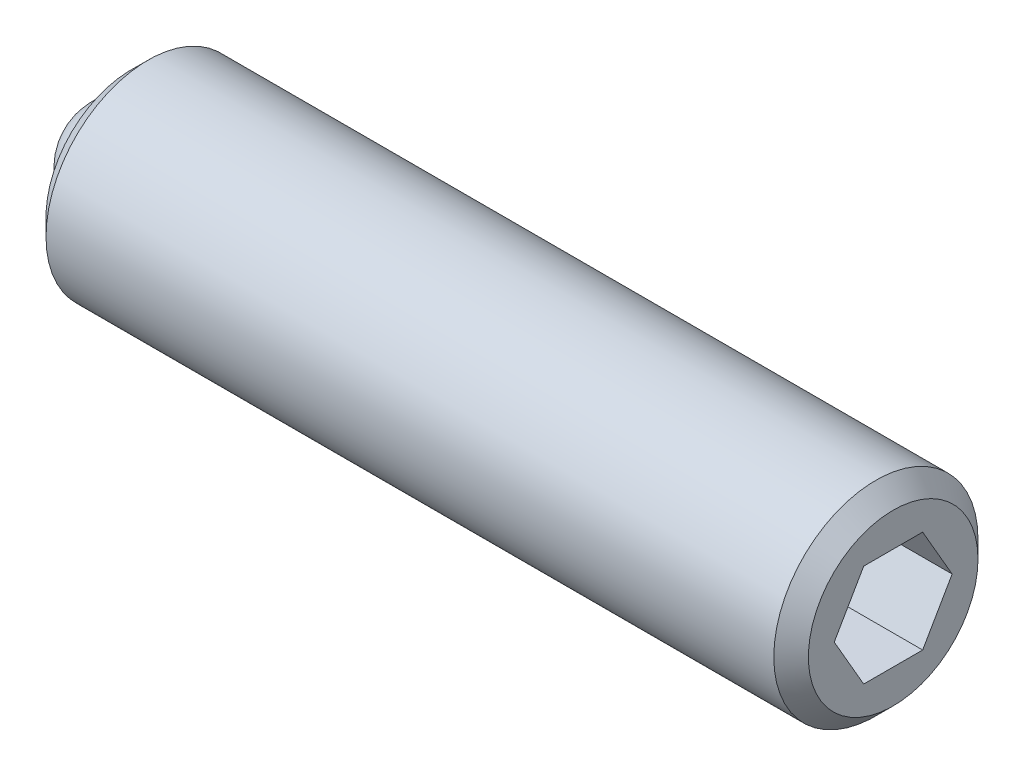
ISO-10303-21;
HEADER;
FILE_DESCRIPTION(('STEP AP214'),'2;1');
FILE_NAME('part.step','',(''),(''),'','','');
FILE_SCHEMA(('AUTOMOTIVE_DESIGN { 1 0 10303 214 1 1 1 1 }'));
ENDSEC;
DATA;
#1=APPLICATION_CONTEXT('core data for automotive mechanical design processes');
#2=APPLICATION_PROTOCOL_DEFINITION('international standard','automotive_design',2000,#1);
#3=PRODUCT_CONTEXT('',#1,'mechanical');
#4=PRODUCT('Part','Part','',(#3));
#5=PRODUCT_RELATED_PRODUCT_CATEGORY('part','',(#4));
#6=PRODUCT_DEFINITION_FORMATION('','',#4);
#7=PRODUCT_DEFINITION_CONTEXT('part definition',#1,'design');
#8=PRODUCT_DEFINITION('design','',#6,#7);
#9=PRODUCT_DEFINITION_SHAPE('','',#8);
#10=(LENGTH_UNIT() NAMED_UNIT(*) SI_UNIT(.MILLI.,.METRE.));
#11=(NAMED_UNIT(*) PLANE_ANGLE_UNIT() SI_UNIT($,.RADIAN.));
#12=(NAMED_UNIT(*) SI_UNIT($,.STERADIAN.) SOLID_ANGLE_UNIT());
#13=UNCERTAINTY_MEASURE_WITH_UNIT(LENGTH_MEASURE(1.E-05),#10,'distance_accuracy_value','');
#14=(GEOMETRIC_REPRESENTATION_CONTEXT(3) GLOBAL_UNCERTAINTY_ASSIGNED_CONTEXT((#13)) GLOBAL_UNIT_ASSIGNED_CONTEXT((#10,
#11,#12)) REPRESENTATION_CONTEXT('',''));
#15=CARTESIAN_POINT('',(0.,0.,0.));
#16=DIRECTION('',(0.,0.,1.));
#17=DIRECTION('',(1.,0.,0.));
#18=AXIS2_PLACEMENT_3D('',#15,#16,#17);
#19=CARTESIAN_POINT('',(0.,0.,0.));
#20=DIRECTION('',(0.,-1.,0.));
#21=DIRECTION('',(0.,0.,-1.));
#22=AXIS2_PLACEMENT_3D('',#19,#20,#21);
#23=SPHERICAL_SURFACE('',#22,0.8);
#24=CARTESIAN_POINT('',(0.,-0.8,0.));
#25=VERTEX_POINT('',#24);
#26=VERTEX_LOOP('',#25);
#27=FACE_BOUND('',#26,.T.);
#28=ADVANCED_FACE('F41',(#27),#23,.T.);
#29=CLOSED_SHELL('',(#28));
#30=MANIFOLD_SOLID_BREP('B2',#29);
#31=CARTESIAN_POINT('',(11.2,0.,0.));
#32=DIRECTION('',(-1.,0.,0.));
#33=DIRECTION('',(0.,0.,1.));
#34=AXIS2_PLACEMENT_3D('',#31,#32,#33);
#35=CYLINDRICAL_SURFACE('',#34,1.5);
#36=CARTESIAN_POINT('',(10.946,0.,0.));
#37=DIRECTION('',(1.,0.,0.));
#38=DIRECTION('',(0.,0.,-1.));
#39=AXIS2_PLACEMENT_3D('',#36,#37,#38);
#40=CIRCLE('',#39,1.5);
#41=CARTESIAN_POINT('',(10.946,0.,-1.5));
#42=VERTEX_POINT('',#41);
#43=EDGE_CURVE('E39',#42,#42,#40,.F.);
#44=ORIENTED_EDGE('',*,*,#43,.T.);
#45=EDGE_LOOP('',(#44));
#46=FACE_BOUND('',#45,.T.);
#47=CARTESIAN_POINT('',(0.254000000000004,0.,0.));
#48=DIRECTION('',(1.,0.,0.));
#49=DIRECTION('',(0.,0.,-1.));
#50=AXIS2_PLACEMENT_3D('',#47,#48,#49);
#51=CIRCLE('',#50,1.5);
#52=CARTESIAN_POINT('',(0.254000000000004,0.,-1.5));
#53=VERTEX_POINT('',#52);
#54=EDGE_CURVE('E176',#53,#53,#51,.T.);
#55=ORIENTED_EDGE('',*,*,#54,.T.);
#56=EDGE_LOOP('',(#55));
#57=FACE_BOUND('',#56,.T.);
#58=ADVANCED_FACE('F54',(#46,#57),#35,.T.);
#59=CARTESIAN_POINT('',(11.2,0.,0.));
#60=DIRECTION('',(1.,0.,0.));
#61=DIRECTION('',(0.,0.,-1.));
#62=AXIS2_PLACEMENT_3D('',#59,#60,#61);
#63=PLANE('',#62);
#64=DIRECTION('',(0.,0.866025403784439,-0.5));
#65=VECTOR('',#64,1.);
#66=CARTESIAN_POINT('',(11.2,-0.75,-0.43301270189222));
#67=LINE('',#66,#65);
#68=CARTESIAN_POINT('',(11.2,-0.75,-0.43301270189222));
#69=VERTEX_POINT('',#68);
#70=CARTESIAN_POINT('',(11.2,0.,-0.866025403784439));
#71=VERTEX_POINT('',#70);
#72=EDGE_CURVE('E77',#69,#71,#67,.T.);
#73=ORIENTED_EDGE('',*,*,#72,.F.);
#74=DIRECTION('',(0.,0.,-1.));
#75=VECTOR('',#74,1.);
#76=CARTESIAN_POINT('',(11.2,-0.75,0.433012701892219));
#77=LINE('',#76,#75);
#78=CARTESIAN_POINT('',(11.2,-0.75,0.433012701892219));
#79=VERTEX_POINT('',#78);
#80=EDGE_CURVE('E143',#79,#69,#77,.T.);
#81=ORIENTED_EDGE('',*,*,#80,.F.);
#82=DIRECTION('',(0.,-0.866025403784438,-0.5));
#83=VECTOR('',#82,1.);
#84=CARTESIAN_POINT('',(11.2,0.,0.866025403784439));
#85=LINE('',#84,#83);
#86=CARTESIAN_POINT('',(11.2,0.,0.866025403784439));
#87=VERTEX_POINT('',#86);
#88=EDGE_CURVE('E169',#87,#79,#85,.T.);
#89=ORIENTED_EDGE('',*,*,#88,.F.);
#90=DIRECTION('',(0.,-0.866025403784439,0.5));
#91=VECTOR('',#90,1.);
#92=CARTESIAN_POINT('',(11.2,0.75,0.433012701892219));
#93=LINE('',#92,#91);
#94=CARTESIAN_POINT('',(11.2,0.75,0.433012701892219));
#95=VERTEX_POINT('',#94);
#96=EDGE_CURVE('E166',#95,#87,#93,.T.);
#97=ORIENTED_EDGE('',*,*,#96,.F.);
#98=DIRECTION('',(0.,0.,1.));
#99=VECTOR('',#98,1.);
#100=CARTESIAN_POINT('',(11.2,0.75,-0.433012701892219));
#101=LINE('',#100,#99);
#102=CARTESIAN_POINT('',(11.2,0.75,-0.433012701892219));
#103=VERTEX_POINT('',#102);
#104=EDGE_CURVE('E163',#103,#95,#101,.T.);
#105=ORIENTED_EDGE('',*,*,#104,.F.);
#106=DIRECTION('',(0.,0.866025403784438,0.5));
#107=VECTOR('',#106,1.);
#108=CARTESIAN_POINT('',(11.2,0.,-0.866025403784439));
#109=LINE('',#108,#107);
#110=EDGE_CURVE('E160',#71,#103,#109,.T.);
#111=ORIENTED_EDGE('',*,*,#110,.F.);
#112=EDGE_LOOP('',(#73,#81,#89,#97,#105,#111));
#113=FACE_BOUND('',#112,.T.);
#114=CARTESIAN_POINT('',(11.2,0.,0.));
#115=DIRECTION('',(1.,0.,0.));
#116=DIRECTION('',(0.,0.,-1.));
#117=AXIS2_PLACEMENT_3D('',#114,#115,#116);
#118=CIRCLE('',#117,1.246);
#119=CARTESIAN_POINT('',(11.2,0.,-1.246));
#120=VERTEX_POINT('',#119);
#121=EDGE_CURVE('E62',#120,#120,#118,.T.);
#122=ORIENTED_EDGE('',*,*,#121,.T.);
#123=EDGE_LOOP('',(#122));
#124=FACE_BOUND('',#123,.T.);
#125=ADVANCED_FACE('F193',(#113,#124),#63,.T.);
#126=CARTESIAN_POINT('',(0.,0.,0.));
#127=DIRECTION('',(1.,0.,0.));
#128=DIRECTION('',(0.,0.,-1.));
#129=AXIS2_PLACEMENT_3D('',#126,#127,#128);
#130=PLANE('',#129);
#131=CARTESIAN_POINT('',(0.,0.,0.));
#132=DIRECTION('',(-1.,0.,0.));
#133=DIRECTION('',(0.,0.,1.));
#134=AXIS2_PLACEMENT_3D('',#131,#132,#133);
#135=CIRCLE('',#134,0.8);
#136=CARTESIAN_POINT('',(0.,0.79747984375,-0.0634499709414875));
#137=VERTEX_POINT('',#136);
#138=CARTESIAN_POINT('',(0.,0.79747984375,0.0634499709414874));
#139=VERTEX_POINT('',#138);
#140=EDGE_CURVE('E128',#137,#139,#135,.T.);
#141=ORIENTED_EDGE('',*,*,#140,.F.);
#142=CARTESIAN_POINT('',(0.,0.8,0.));
#143=DIRECTION('',(-1.,0.,0.));
#144=DIRECTION('',(0.,0.,1.));
#145=AXIS2_PLACEMENT_3D('',#142,#143,#144);
#146=CIRCLE('',#145,0.0635000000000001);
#147=EDGE_CURVE('E117',#139,#137,#146,.T.);
#148=ORIENTED_EDGE('',*,*,#147,.F.);
#149=EDGE_LOOP('',(#141,#148));
#150=FACE_BOUND('',#149,.T.);
#151=CARTESIAN_POINT('',(0.,0.,0.));
#152=DIRECTION('',(1.,0.,0.));
#153=DIRECTION('',(0.,0.,-1.));
#154=AXIS2_PLACEMENT_3D('',#151,#152,#153);
#155=CIRCLE('',#154,1.246);
#156=CARTESIAN_POINT('',(0.,0.,-1.246));
#157=VERTEX_POINT('',#156);
#158=EDGE_CURVE('E188',#157,#157,#155,.F.);
#159=ORIENTED_EDGE('',*,*,#158,.T.);
#160=EDGE_LOOP('',(#159));
#161=FACE_BOUND('',#160,.T.);
#162=ADVANCED_FACE('F132',(#150,#161),#130,.F.);
#163=CARTESIAN_POINT('',(0.254000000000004,0.,0.));
#164=DIRECTION('',(1.,0.,0.));
#165=DIRECTION('',(0.,0.,-1.));
#166=AXIS2_PLACEMENT_3D('',#163,#164,#165);
#167=CONICAL_SURFACE('',#166,1.5,0.785398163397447);
#168=ORIENTED_EDGE('',*,*,#158,.F.);
#169=EDGE_LOOP('',(#168));
#170=FACE_BOUND('',#169,.T.);
#171=ORIENTED_EDGE('',*,*,#54,.F.);
#172=EDGE_LOOP('',(#171));
#173=FACE_BOUND('',#172,.T.);
#174=ADVANCED_FACE('F197',(#170,#173),#167,.T.);
#175=CARTESIAN_POINT('',(11.2,0.,0.));
#176=DIRECTION('',(-1.,0.,0.));
#177=DIRECTION('',(0.,0.,1.));
#178=AXIS2_PLACEMENT_3D('',#175,#176,#177);
#179=CONICAL_SURFACE('',#178,1.246,0.785398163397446);
#180=ORIENTED_EDGE('',*,*,#43,.F.);
#181=EDGE_LOOP('',(#180));
#182=FACE_BOUND('',#181,.T.);
#183=ORIENTED_EDGE('',*,*,#121,.F.);
#184=EDGE_LOOP('',(#183));
#185=FACE_BOUND('',#184,.T.);
#186=ADVANCED_FACE('F56',(#182,#185),#179,.T.);
#187=CARTESIAN_POINT('',(9.2,-0.75,-0.43301270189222));
#188=DIRECTION('',(0.,-0.5,-0.866025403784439));
#189=DIRECTION('',(0.,0.866025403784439,-0.5));
#190=AXIS2_PLACEMENT_3D('',#187,#188,#189);
#191=PLANE('',#190);
#192=ORIENTED_EDGE('',*,*,#72,.T.);
#193=DIRECTION('',(1.,0.,0.));
#194=VECTOR('',#193,1.);
#195=CARTESIAN_POINT('',(9.2,0.,-0.866025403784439));
#196=LINE('',#195,#194);
#197=CARTESIAN_POINT('',(9.2,0.,-0.866025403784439));
#198=VERTEX_POINT('',#197);
#199=EDGE_CURVE('E158',#198,#71,#196,.T.);
#200=ORIENTED_EDGE('',*,*,#199,.F.);
#201=DIRECTION('',(0.,0.866025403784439,-0.5));
#202=VECTOR('',#201,1.);
#203=CARTESIAN_POINT('',(9.2,-0.75,-0.43301270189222));
#204=LINE('',#203,#202);
#205=CARTESIAN_POINT('',(9.2,-0.75,-0.43301270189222));
#206=VERTEX_POINT('',#205);
#207=EDGE_CURVE('E139',#206,#198,#204,.T.);
#208=ORIENTED_EDGE('',*,*,#207,.F.);
#209=DIRECTION('',(1.,0.,0.));
#210=VECTOR('',#209,1.);
#211=CARTESIAN_POINT('',(9.2,-0.75,-0.43301270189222));
#212=LINE('',#211,#210);
#213=EDGE_CURVE('E174',#206,#69,#212,.T.);
#214=ORIENTED_EDGE('',*,*,#213,.T.);
#215=EDGE_LOOP('',(#192,#200,#208,#214));
#216=FACE_BOUND('',#215,.T.);
#217=ADVANCED_FACE('F196',(#216),#191,.F.);
#218=CARTESIAN_POINT('',(9.2,-0.75,0.433012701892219));
#219=DIRECTION('',(0.,-1.,0.));
#220=DIRECTION('',(0.,0.,-1.));
#221=AXIS2_PLACEMENT_3D('',#218,#219,#220);
#222=PLANE('',#221);
#223=ORIENTED_EDGE('',*,*,#80,.T.);
#224=ORIENTED_EDGE('',*,*,#213,.F.);
#225=DIRECTION('',(0.,0.,-1.));
#226=VECTOR('',#225,1.);
#227=CARTESIAN_POINT('',(9.2,-0.75,0.433012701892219));
#228=LINE('',#227,#226);
#229=CARTESIAN_POINT('',(9.2,-0.75,0.433012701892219));
#230=VERTEX_POINT('',#229);
#231=EDGE_CURVE('E155',#230,#206,#228,.T.);
#232=ORIENTED_EDGE('',*,*,#231,.F.);
#233=DIRECTION('',(1.,0.,0.));
#234=VECTOR('',#233,1.);
#235=CARTESIAN_POINT('',(9.2,-0.75,0.433012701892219));
#236=LINE('',#235,#234);
#237=EDGE_CURVE('E177',#230,#79,#236,.T.);
#238=ORIENTED_EDGE('',*,*,#237,.T.);
#239=EDGE_LOOP('',(#223,#224,#232,#238));
#240=FACE_BOUND('',#239,.T.);
#241=ADVANCED_FACE('F203',(#240),#222,.F.);
#242=CARTESIAN_POINT('',(9.2,0.,0.866025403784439));
#243=DIRECTION('',(0.,-0.5,0.866025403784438));
#244=DIRECTION('',(0.,-0.866025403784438,-0.5));
#245=AXIS2_PLACEMENT_3D('',#242,#243,#244);
#246=PLANE('',#245);
#247=ORIENTED_EDGE('',*,*,#88,.T.);
#248=ORIENTED_EDGE('',*,*,#237,.F.);
#249=DIRECTION('',(0.,-0.866025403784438,-0.5));
#250=VECTOR('',#249,1.);
#251=CARTESIAN_POINT('',(9.2,0.,0.866025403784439));
#252=LINE('',#251,#250);
#253=CARTESIAN_POINT('',(9.2,0.,0.866025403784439));
#254=VERTEX_POINT('',#253);
#255=EDGE_CURVE('E152',#254,#230,#252,.T.);
#256=ORIENTED_EDGE('',*,*,#255,.F.);
#257=DIRECTION('',(1.,0.,0.));
#258=VECTOR('',#257,1.);
#259=CARTESIAN_POINT('',(9.2,0.,0.866025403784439));
#260=LINE('',#259,#258);
#261=EDGE_CURVE('E179',#254,#87,#260,.T.);
#262=ORIENTED_EDGE('',*,*,#261,.T.);
#263=EDGE_LOOP('',(#247,#248,#256,#262));
#264=FACE_BOUND('',#263,.T.);
#265=ADVANCED_FACE('F231',(#264),#246,.F.);
#266=CARTESIAN_POINT('',(9.2,0.75,0.433012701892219));
#267=DIRECTION('',(0.,0.5,0.866025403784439));
#268=DIRECTION('',(0.,-0.866025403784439,0.5));
#269=AXIS2_PLACEMENT_3D('',#266,#267,#268);
#270=PLANE('',#269);
#271=ORIENTED_EDGE('',*,*,#96,.T.);
#272=ORIENTED_EDGE('',*,*,#261,.F.);
#273=DIRECTION('',(0.,-0.866025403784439,0.5));
#274=VECTOR('',#273,1.);
#275=CARTESIAN_POINT('',(9.2,0.75,0.433012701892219));
#276=LINE('',#275,#274);
#277=CARTESIAN_POINT('',(9.2,0.75,0.433012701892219));
#278=VERTEX_POINT('',#277);
#279=EDGE_CURVE('E149',#278,#254,#276,.T.);
#280=ORIENTED_EDGE('',*,*,#279,.F.);
#281=DIRECTION('',(1.,0.,0.));
#282=VECTOR('',#281,1.);
#283=CARTESIAN_POINT('',(9.2,0.75,0.433012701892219));
#284=LINE('',#283,#282);
#285=EDGE_CURVE('E181',#278,#95,#284,.T.);
#286=ORIENTED_EDGE('',*,*,#285,.T.);
#287=EDGE_LOOP('',(#271,#272,#280,#286));
#288=FACE_BOUND('',#287,.T.);
#289=ADVANCED_FACE('F227',(#288),#270,.F.);
#290=CARTESIAN_POINT('',(9.2,0.75,-0.433012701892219));
#291=DIRECTION('',(0.,1.,0.));
#292=DIRECTION('',(0.,0.,1.));
#293=AXIS2_PLACEMENT_3D('',#290,#291,#292);
#294=PLANE('',#293);
#295=ORIENTED_EDGE('',*,*,#104,.T.);
#296=ORIENTED_EDGE('',*,*,#285,.F.);
#297=DIRECTION('',(0.,0.,1.));
#298=VECTOR('',#297,1.);
#299=CARTESIAN_POINT('',(9.2,0.75,-0.433012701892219));
#300=LINE('',#299,#298);
#301=CARTESIAN_POINT('',(9.2,0.75,-0.433012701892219));
#302=VERTEX_POINT('',#301);
#303=EDGE_CURVE('E146',#302,#278,#300,.T.);
#304=ORIENTED_EDGE('',*,*,#303,.F.);
#305=DIRECTION('',(1.,0.,0.));
#306=VECTOR('',#305,1.);
#307=CARTESIAN_POINT('',(9.2,0.75,-0.433012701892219));
#308=LINE('',#307,#306);
#309=EDGE_CURVE('E183',#302,#103,#308,.T.);
#310=ORIENTED_EDGE('',*,*,#309,.T.);
#311=EDGE_LOOP('',(#295,#296,#304,#310));
#312=FACE_BOUND('',#311,.T.);
#313=ADVANCED_FACE('F223',(#312),#294,.F.);
#314=CARTESIAN_POINT('',(9.2,0.,-0.866025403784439));
#315=DIRECTION('',(0.,0.500000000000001,-0.866025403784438));
#316=DIRECTION('',(0.,0.866025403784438,0.500000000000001));
#317=AXIS2_PLACEMENT_3D('',#314,#315,#316);
#318=PLANE('',#317);
#319=ORIENTED_EDGE('',*,*,#110,.T.);
#320=ORIENTED_EDGE('',*,*,#309,.F.);
#321=DIRECTION('',(0.,0.866025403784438,0.5));
#322=VECTOR('',#321,1.);
#323=CARTESIAN_POINT('',(9.2,0.,-0.866025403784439));
#324=LINE('',#323,#322);
#325=EDGE_CURVE('E142',#198,#302,#324,.T.);
#326=ORIENTED_EDGE('',*,*,#325,.F.);
#327=ORIENTED_EDGE('',*,*,#199,.T.);
#328=EDGE_LOOP('',(#319,#320,#326,#327));
#329=FACE_BOUND('',#328,.T.);
#330=ADVANCED_FACE('F219',(#329),#318,.F.);
#331=CARTESIAN_POINT('',(9.2,0.,0.));
#332=DIRECTION('',(1.,0.,0.));
#333=DIRECTION('',(0.,0.,-1.));
#334=AXIS2_PLACEMENT_3D('',#331,#332,#333);
#335=PLANE('',#334);
#336=ORIENTED_EDGE('',*,*,#207,.T.);
#337=ORIENTED_EDGE('',*,*,#325,.T.);
#338=ORIENTED_EDGE('',*,*,#303,.T.);
#339=ORIENTED_EDGE('',*,*,#279,.T.);
#340=ORIENTED_EDGE('',*,*,#255,.T.);
#341=ORIENTED_EDGE('',*,*,#231,.T.);
#342=EDGE_LOOP('',(#336,#337,#338,#339,#340,#341));
#343=FACE_BOUND('',#342,.T.);
#344=ADVANCED_FACE('F222',(#343),#335,.T.);
#345=CARTESIAN_POINT('',(0.8,0.,0.));
#346=DIRECTION('',(-1.,0.,0.));
#347=DIRECTION('',(0.,0.,1.));
#348=AXIS2_PLACEMENT_3D('',#345,#346,#347);
#349=CYLINDRICAL_SURFACE('',#348,0.8);
#350=CARTESIAN_POINT('',(0.8,0.,0.));
#351=DIRECTION('',(-1.,0.,0.));
#352=DIRECTION('',(0.,0.,1.));
#353=AXIS2_PLACEMENT_3D('',#350,#351,#352);
#354=CIRCLE('',#353,0.8);
#355=CARTESIAN_POINT('',(0.8,0.79747984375,-0.0634499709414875));
#356=VERTEX_POINT('',#355);
#357=CARTESIAN_POINT('',(0.8,0.79747984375,0.0634499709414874));
#358=VERTEX_POINT('',#357);
#359=EDGE_CURVE('E130',#356,#358,#354,.T.);
#360=ORIENTED_EDGE('',*,*,#359,.F.);
#361=DIRECTION('',(-1.,0.,0.));
#362=VECTOR('',#361,1.);
#363=CARTESIAN_POINT('',(0.94313511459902,0.79747984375,-0.0634499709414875));
#364=LINE('',#363,#362);
#365=EDGE_CURVE('E69',#356,#137,#364,.T.);
#366=ORIENTED_EDGE('',*,*,#365,.T.);
#367=ORIENTED_EDGE('',*,*,#140,.T.);
#368=DIRECTION('',(-1.,0.,0.));
#369=VECTOR('',#368,1.);
#370=CARTESIAN_POINT('',(0.94313511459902,0.79747984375,0.0634499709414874));
#371=LINE('',#370,#369);
#372=EDGE_CURVE('E120',#358,#139,#371,.T.);
#373=ORIENTED_EDGE('',*,*,#372,.F.);
#374=EDGE_LOOP('',(#360,#366,#367,#373));
#375=FACE_BOUND('',#374,.T.);
#376=ADVANCED_FACE('F127',(#375),#349,.F.);
#377=CARTESIAN_POINT('',(0.8,0.,0.));
#378=DIRECTION('',(-1.,0.,0.));
#379=DIRECTION('',(0.,0.,1.));
#380=AXIS2_PLACEMENT_3D('',#377,#378,#379);
#381=PLANE('',#380);
#382=ORIENTED_EDGE('',*,*,#359,.T.);
#383=CARTESIAN_POINT('',(0.8,0.8,0.));
#384=DIRECTION('',(-1.,0.,0.));
#385=DIRECTION('',(0.,0.,1.));
#386=AXIS2_PLACEMENT_3D('',#383,#384,#385);
#387=CIRCLE('',#386,0.0635000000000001);
#388=EDGE_CURVE('E134',#356,#358,#387,.F.);
#389=ORIENTED_EDGE('',*,*,#388,.F.);
#390=EDGE_LOOP('',(#382,#389));
#391=FACE_BOUND('',#390,.T.);
#392=ADVANCED_FACE('F244',(#391),#381,.T.);
#393=CARTESIAN_POINT('',(0.94313511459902,0.8,0.));
#394=DIRECTION('',(-1.,0.,0.));
#395=DIRECTION('',(0.,0.,1.));
#396=AXIS2_PLACEMENT_3D('',#393,#394,#395);
#397=CYLINDRICAL_SURFACE('',#396,0.0635000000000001);
#398=ORIENTED_EDGE('',*,*,#388,.T.);
#399=ORIENTED_EDGE('',*,*,#372,.T.);
#400=ORIENTED_EDGE('',*,*,#147,.T.);
#401=ORIENTED_EDGE('',*,*,#365,.F.);
#402=EDGE_LOOP('',(#398,#399,#400,#401));
#403=FACE_BOUND('',#402,.T.);
#404=ADVANCED_FACE('F118',(#403),#397,.F.);
#405=CLOSED_SHELL('',(#58,#125,#162,#174,#186,#217,#241,#265,#289,#313,#330,#344,#376,#392,#404));
#406=MANIFOLD_SOLID_BREP('B6',#405);
#407=ADVANCED_BREP_SHAPE_REPRESENTATION('',(#18,#30,#406),#14);
#408=SHAPE_DEFINITION_REPRESENTATION(#9,#407);
ENDSEC;
END-ISO-10303-21;
